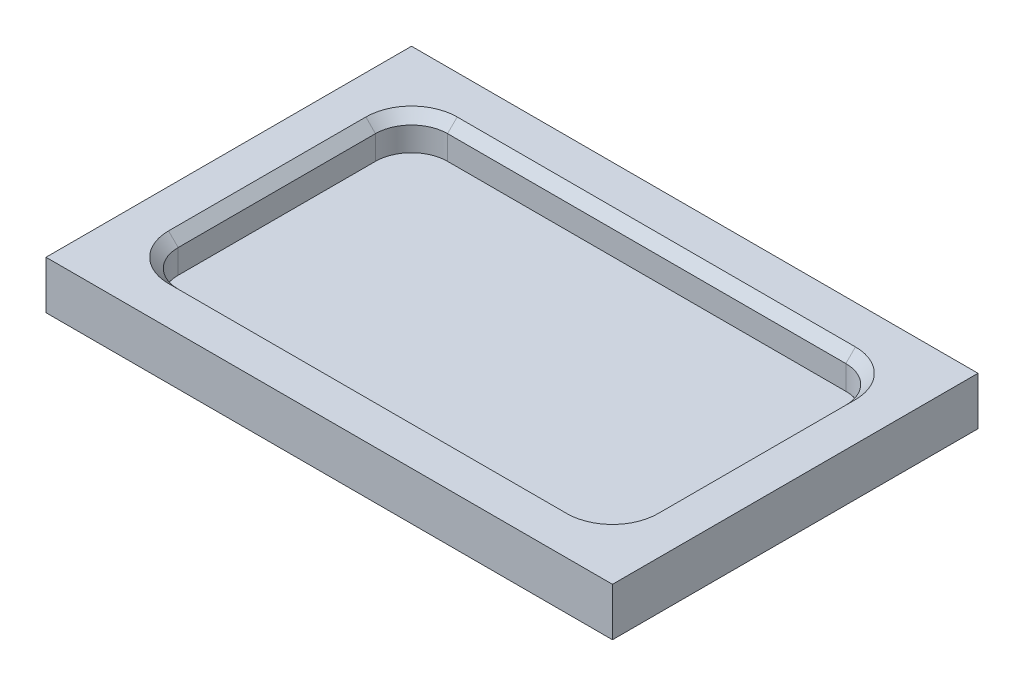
ISO-10303-21;
HEADER;
FILE_DESCRIPTION(('STEP AP214'),'2;1');
FILE_NAME('part.step','',(''),(''),'','','');
FILE_SCHEMA(('AUTOMOTIVE_DESIGN { 1 0 10303 214 1 1 1 1 }'));
ENDSEC;
DATA;
#1=APPLICATION_CONTEXT('core data for automotive mechanical design processes');
#2=APPLICATION_PROTOCOL_DEFINITION('international standard','automotive_design',2000,#1);
#3=PRODUCT_CONTEXT('',#1,'mechanical');
#4=PRODUCT('Part','Part','',(#3));
#5=PRODUCT_RELATED_PRODUCT_CATEGORY('part','',(#4));
#6=PRODUCT_DEFINITION_FORMATION('','',#4);
#7=PRODUCT_DEFINITION_CONTEXT('part definition',#1,'design');
#8=PRODUCT_DEFINITION('design','',#6,#7);
#9=PRODUCT_DEFINITION_SHAPE('','',#8);
#10=(LENGTH_UNIT() NAMED_UNIT(*) SI_UNIT(.MILLI.,.METRE.));
#11=(NAMED_UNIT(*) PLANE_ANGLE_UNIT() SI_UNIT($,.RADIAN.));
#12=(NAMED_UNIT(*) SI_UNIT($,.STERADIAN.) SOLID_ANGLE_UNIT());
#13=UNCERTAINTY_MEASURE_WITH_UNIT(LENGTH_MEASURE(1.E-05),#10,'distance_accuracy_value','');
#14=(GEOMETRIC_REPRESENTATION_CONTEXT(3) GLOBAL_UNCERTAINTY_ASSIGNED_CONTEXT((#13)) GLOBAL_UNIT_ASSIGNED_CONTEXT((#10,
#11,#12)) REPRESENTATION_CONTEXT('',''));
#15=CARTESIAN_POINT('',(0.,0.,0.));
#16=DIRECTION('',(0.,0.,1.));
#17=DIRECTION('',(1.,0.,0.));
#18=AXIS2_PLACEMENT_3D('',#15,#16,#17);
#19=CARTESIAN_POINT('',(-62.714146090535,12.7,-44.4034465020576));
#20=DIRECTION('',(1.,0.,0.));
#21=DIRECTION('',(0.,0.,-1.));
#22=AXIS2_PLACEMENT_3D('',#19,#20,#21);
#23=PLANE('',#22);
#24=DIRECTION('',(0.,0.,1.));
#25=VECTOR('',#24,1.);
#26=CARTESIAN_POINT('',(-62.714146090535,0.,-44.4034465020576));
#27=LINE('',#26,#25);
#28=CARTESIAN_POINT('',(-62.714146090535,0.,-44.4034465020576));
#29=VERTEX_POINT('',#28);
#30=CARTESIAN_POINT('',(-62.714146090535,0.,52.1854938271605));
#31=VERTEX_POINT('',#30);
#32=EDGE_CURVE('E155',#29,#31,#27,.T.);
#33=ORIENTED_EDGE('',*,*,#32,.T.);
#34=DIRECTION('',(0.,-1.,0.));
#35=VECTOR('',#34,1.);
#36=CARTESIAN_POINT('',(-62.714146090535,12.7,52.1854938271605));
#37=LINE('',#36,#35);
#38=CARTESIAN_POINT('',(-62.714146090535,12.7,52.1854938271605));
#39=VERTEX_POINT('',#38);
#40=EDGE_CURVE('E162',#39,#31,#37,.T.);
#41=ORIENTED_EDGE('',*,*,#40,.F.);
#42=DIRECTION('',(0.,0.,1.));
#43=VECTOR('',#42,1.);
#44=CARTESIAN_POINT('',(-62.714146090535,12.7,-44.4034465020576));
#45=LINE('',#44,#43);
#46=CARTESIAN_POINT('',(-62.714146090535,12.7,-44.4034465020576));
#47=VERTEX_POINT('',#46);
#48=EDGE_CURVE('E184',#47,#39,#45,.T.);
#49=ORIENTED_EDGE('',*,*,#48,.F.);
#50=DIRECTION('',(0.,-1.,0.));
#51=VECTOR('',#50,1.);
#52=CARTESIAN_POINT('',(-62.714146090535,12.7,-44.4034465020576));
#53=LINE('',#52,#51);
#54=EDGE_CURVE('E173',#47,#29,#53,.T.);
#55=ORIENTED_EDGE('',*,*,#54,.T.);
#56=EDGE_LOOP('',(#33,#41,#49,#55));
#57=FACE_BOUND('',#56,.T.);
#58=ADVANCED_FACE('F38',(#57),#23,.F.);
#59=CARTESIAN_POINT('',(-62.714146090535,12.7,52.1854938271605));
#60=DIRECTION('',(0.,0.,-1.));
#61=DIRECTION('',(-1.,0.,0.));
#62=AXIS2_PLACEMENT_3D('',#59,#60,#61);
#63=PLANE('',#62);
#64=DIRECTION('',(1.,0.,0.));
#65=VECTOR('',#64,1.);
#66=CARTESIAN_POINT('',(-62.714146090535,0.,52.1854938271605));
#67=LINE('',#66,#65);
#68=CARTESIAN_POINT('',(86.9758230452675,0.,52.1854938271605));
#69=VERTEX_POINT('',#68);
#70=EDGE_CURVE('E150',#31,#69,#67,.T.);
#71=ORIENTED_EDGE('',*,*,#70,.T.);
#72=DIRECTION('',(0.,-1.,0.));
#73=VECTOR('',#72,1.);
#74=CARTESIAN_POINT('',(86.9758230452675,12.7,52.1854938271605));
#75=LINE('',#74,#73);
#76=CARTESIAN_POINT('',(86.9758230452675,12.7,52.1854938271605));
#77=VERTEX_POINT('',#76);
#78=EDGE_CURVE('E169',#77,#69,#75,.T.);
#79=ORIENTED_EDGE('',*,*,#78,.F.);
#80=DIRECTION('',(1.,0.,0.));
#81=VECTOR('',#80,1.);
#82=CARTESIAN_POINT('',(-62.714146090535,12.7,52.1854938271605));
#83=LINE('',#82,#81);
#84=EDGE_CURVE('E164',#39,#77,#83,.T.);
#85=ORIENTED_EDGE('',*,*,#84,.F.);
#86=ORIENTED_EDGE('',*,*,#40,.T.);
#87=EDGE_LOOP('',(#71,#79,#85,#86));
#88=FACE_BOUND('',#87,.T.);
#89=ADVANCED_FACE('F163',(#88),#63,.F.);
#90=CARTESIAN_POINT('',(86.9758230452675,12.7,-44.4034465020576));
#91=DIRECTION('',(-1.,0.,0.));
#92=DIRECTION('',(0.,0.,1.));
#93=AXIS2_PLACEMENT_3D('',#90,#91,#92);
#94=PLANE('',#93);
#95=DIRECTION('',(0.,0.,-1.));
#96=VECTOR('',#95,1.);
#97=CARTESIAN_POINT('',(86.9758230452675,0.,-44.4034465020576));
#98=LINE('',#97,#96);
#99=CARTESIAN_POINT('',(86.9758230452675,0.,-44.4034465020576));
#100=VERTEX_POINT('',#99);
#101=EDGE_CURVE('E156',#69,#100,#98,.T.);
#102=ORIENTED_EDGE('',*,*,#101,.T.);
#103=DIRECTION('',(0.,-1.,0.));
#104=VECTOR('',#103,1.);
#105=CARTESIAN_POINT('',(86.9758230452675,12.7,-44.4034465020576));
#106=LINE('',#105,#104);
#107=CARTESIAN_POINT('',(86.9758230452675,12.7,-44.4034465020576));
#108=VERTEX_POINT('',#107);
#109=EDGE_CURVE('E192',#108,#100,#106,.T.);
#110=ORIENTED_EDGE('',*,*,#109,.F.);
#111=DIRECTION('',(0.,0.,-1.));
#112=VECTOR('',#111,1.);
#113=CARTESIAN_POINT('',(86.9758230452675,12.7,-44.4034465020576));
#114=LINE('',#113,#112);
#115=EDGE_CURVE('E187',#77,#108,#114,.T.);
#116=ORIENTED_EDGE('',*,*,#115,.F.);
#117=ORIENTED_EDGE('',*,*,#78,.T.);
#118=EDGE_LOOP('',(#102,#110,#116,#117));
#119=FACE_BOUND('',#118,.T.);
#120=ADVANCED_FACE('F352',(#119),#94,.F.);
#121=CARTESIAN_POINT('',(-62.714146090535,12.7,-44.4034465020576));
#122=DIRECTION('',(0.,0.,1.));
#123=DIRECTION('',(1.,0.,0.));
#124=AXIS2_PLACEMENT_3D('',#121,#122,#123);
#125=PLANE('',#124);
#126=DIRECTION('',(-1.,0.,0.));
#127=VECTOR('',#126,1.);
#128=CARTESIAN_POINT('',(-62.714146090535,0.,-44.4034465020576));
#129=LINE('',#128,#127);
#130=EDGE_CURVE('E182',#100,#29,#129,.T.);
#131=ORIENTED_EDGE('',*,*,#130,.T.);
#132=ORIENTED_EDGE('',*,*,#54,.F.);
#133=DIRECTION('',(-1.,0.,0.));
#134=VECTOR('',#133,1.);
#135=CARTESIAN_POINT('',(-62.714146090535,12.7,-44.4034465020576));
#136=LINE('',#135,#134);
#137=EDGE_CURVE('E189',#108,#47,#136,.T.);
#138=ORIENTED_EDGE('',*,*,#137,.F.);
#139=ORIENTED_EDGE('',*,*,#109,.T.);
#140=EDGE_LOOP('',(#131,#132,#138,#139));
#141=FACE_BOUND('',#140,.T.);
#142=ADVANCED_FACE('F345',(#141),#125,.F.);
#143=CARTESIAN_POINT('',(-62.714146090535,12.7,52.1854938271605));
#144=DIRECTION('',(0.,1.,0.));
#145=DIRECTION('',(0.,0.,1.));
#146=AXIS2_PLACEMENT_3D('',#143,#144,#145);
#147=PLANE('',#146);
#148=CARTESIAN_POINT('',(64.7508230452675,12.7,29.9604938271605));
#149=DIRECTION('',(0.,1.,0.));
#150=DIRECTION('',(0.,0.,1.));
#151=AXIS2_PLACEMENT_3D('',#148,#149,#150);
#152=CIRCLE('',#151,12.065);
#153=CARTESIAN_POINT('',(76.8158230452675,12.7,29.9604938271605));
#154=VERTEX_POINT('',#153);
#155=CARTESIAN_POINT('',(64.7508230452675,12.7,42.0254938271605));
#156=VERTEX_POINT('',#155);
#157=EDGE_CURVE('E237',#154,#156,#152,.F.);
#158=ORIENTED_EDGE('',*,*,#157,.T.);
#159=DIRECTION('',(-1.,0.,0.));
#160=VECTOR('',#159,1.);
#161=CARTESIAN_POINT('',(-40.489146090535,12.7,42.0254938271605));
#162=LINE('',#161,#160);
#163=CARTESIAN_POINT('',(-40.489146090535,12.7,42.0254938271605));
#164=VERTEX_POINT('',#163);
#165=EDGE_CURVE('E239',#156,#164,#162,.T.);
#166=ORIENTED_EDGE('',*,*,#165,.T.);
#167=CARTESIAN_POINT('',(-40.489146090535,12.7,29.9604938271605));
#168=DIRECTION('',(0.,1.,0.));
#169=DIRECTION('',(0.,0.,1.));
#170=AXIS2_PLACEMENT_3D('',#167,#168,#169);
#171=CIRCLE('',#170,12.065);
#172=CARTESIAN_POINT('',(-52.554146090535,12.7,29.9604938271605));
#173=VERTEX_POINT('',#172);
#174=EDGE_CURVE('E235',#164,#173,#171,.F.);
#175=ORIENTED_EDGE('',*,*,#174,.T.);
#176=DIRECTION('',(0.,0.,-1.));
#177=VECTOR('',#176,1.);
#178=CARTESIAN_POINT('',(-52.554146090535,12.7,-22.1784465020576));
#179=LINE('',#178,#177);
#180=CARTESIAN_POINT('',(-52.554146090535,12.7,-22.1784465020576));
#181=VERTEX_POINT('',#180);
#182=EDGE_CURVE('E231',#173,#181,#179,.T.);
#183=ORIENTED_EDGE('',*,*,#182,.T.);
#184=CARTESIAN_POINT('',(-40.489146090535,12.7,-22.1784465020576));
#185=DIRECTION('',(0.,1.,0.));
#186=DIRECTION('',(0.,0.,1.));
#187=AXIS2_PLACEMENT_3D('',#184,#185,#186);
#188=CIRCLE('',#187,12.065);
#189=CARTESIAN_POINT('',(-40.489146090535,12.7,-34.2434465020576));
#190=VERTEX_POINT('',#189);
#191=EDGE_CURVE('E227',#181,#190,#188,.F.);
#192=ORIENTED_EDGE('',*,*,#191,.T.);
#193=DIRECTION('',(1.,0.,0.));
#194=VECTOR('',#193,1.);
#195=CARTESIAN_POINT('',(64.7508230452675,12.7,-34.2434465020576));
#196=LINE('',#195,#194);
#197=CARTESIAN_POINT('',(64.7508230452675,12.7,-34.2434465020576));
#198=VERTEX_POINT('',#197);
#199=EDGE_CURVE('E225',#190,#198,#196,.T.);
#200=ORIENTED_EDGE('',*,*,#199,.T.);
#201=CARTESIAN_POINT('',(64.7508230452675,12.7,-22.1784465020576));
#202=DIRECTION('',(0.,1.,0.));
#203=DIRECTION('',(0.,0.,1.));
#204=AXIS2_PLACEMENT_3D('',#201,#202,#203);
#205=CIRCLE('',#204,12.065);
#206=CARTESIAN_POINT('',(76.8158230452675,12.7,-22.1784465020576));
#207=VERTEX_POINT('',#206);
#208=EDGE_CURVE('E229',#198,#207,#205,.F.);
#209=ORIENTED_EDGE('',*,*,#208,.T.);
#210=DIRECTION('',(0.,0.,1.));
#211=VECTOR('',#210,1.);
#212=CARTESIAN_POINT('',(76.8158230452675,12.7,29.9604938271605));
#213=LINE('',#212,#211);
#214=EDGE_CURVE('E233',#207,#154,#213,.T.);
#215=ORIENTED_EDGE('',*,*,#214,.T.);
#216=EDGE_LOOP('',(#158,#166,#175,#183,#192,#200,#209,#215));
#217=FACE_BOUND('',#216,.T.);
#218=ORIENTED_EDGE('',*,*,#48,.T.);
#219=ORIENTED_EDGE('',*,*,#84,.T.);
#220=ORIENTED_EDGE('',*,*,#115,.T.);
#221=ORIENTED_EDGE('',*,*,#137,.T.);
#222=EDGE_LOOP('',(#218,#219,#220,#221));
#223=FACE_BOUND('',#222,.T.);
#224=ADVANCED_FACE('F342',(#217,#223),#147,.T.);
#225=CARTESIAN_POINT('',(-62.714146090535,0.,52.1854938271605));
#226=DIRECTION('',(0.,1.,0.));
#227=DIRECTION('',(0.,0.,1.));
#228=AXIS2_PLACEMENT_3D('',#225,#226,#227);
#229=PLANE('',#228);
#230=ORIENTED_EDGE('',*,*,#32,.F.);
#231=ORIENTED_EDGE('',*,*,#130,.F.);
#232=ORIENTED_EDGE('',*,*,#101,.F.);
#233=ORIENTED_EDGE('',*,*,#70,.F.);
#234=EDGE_LOOP('',(#230,#231,#232,#233));
#235=FACE_BOUND('',#234,.T.);
#236=ADVANCED_FACE('F152',(#235),#229,.F.);
#237=CARTESIAN_POINT('',(-50.014146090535,3.81,-31.7034465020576));
#238=DIRECTION('',(-1.,0.,0.));
#239=DIRECTION('',(0.,0.,1.));
#240=AXIS2_PLACEMENT_3D('',#237,#238,#239);
#241=PLANE('',#240);
#242=DIRECTION('',(0.,1.,0.));
#243=VECTOR('',#242,1.);
#244=CARTESIAN_POINT('',(-50.014146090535,12.7,-22.1784465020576));
#245=LINE('',#244,#243);
#246=CARTESIAN_POINT('',(-50.014146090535,3.81,-22.1784465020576));
#247=VERTEX_POINT('',#246);
#248=CARTESIAN_POINT('',(-50.014146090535,10.16,-22.1784465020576));
#249=VERTEX_POINT('',#248);
#250=EDGE_CURVE('E217',#247,#249,#245,.T.);
#251=ORIENTED_EDGE('',*,*,#250,.T.);
#252=DIRECTION('',(0.,0.,1.));
#253=VECTOR('',#252,1.);
#254=CARTESIAN_POINT('',(-50.014146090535,10.16,29.9604938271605));
#255=LINE('',#254,#253);
#256=CARTESIAN_POINT('',(-50.014146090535,10.16,29.9604938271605));
#257=VERTEX_POINT('',#256);
#258=EDGE_CURVE('E248',#249,#257,#255,.T.);
#259=ORIENTED_EDGE('',*,*,#258,.T.);
#260=DIRECTION('',(0.,1.,0.));
#261=VECTOR('',#260,1.);
#262=CARTESIAN_POINT('',(-50.014146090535,3.81,29.9604938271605));
#263=LINE('',#262,#261);
#264=CARTESIAN_POINT('',(-50.014146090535,3.81,29.9604938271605));
#265=VERTEX_POINT('',#264);
#266=EDGE_CURVE('E220',#257,#265,#263,.F.);
#267=ORIENTED_EDGE('',*,*,#266,.T.);
#268=DIRECTION('',(0.,0.,1.));
#269=VECTOR('',#268,1.);
#270=CARTESIAN_POINT('',(-50.014146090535,3.81,-31.7034465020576));
#271=LINE('',#270,#269);
#272=EDGE_CURVE('E265',#247,#265,#271,.T.);
#273=ORIENTED_EDGE('',*,*,#272,.F.);
#274=EDGE_LOOP('',(#251,#259,#267,#273));
#275=FACE_BOUND('',#274,.T.);
#276=ADVANCED_FACE('F261',(#275),#241,.F.);
#277=CARTESIAN_POINT('',(-50.014146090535,3.81,-31.7034465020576));
#278=DIRECTION('',(0.,0.,-1.));
#279=DIRECTION('',(-1.,0.,0.));
#280=AXIS2_PLACEMENT_3D('',#277,#278,#279);
#281=PLANE('',#280);
#282=DIRECTION('',(0.,1.,0.));
#283=VECTOR('',#282,1.);
#284=CARTESIAN_POINT('',(64.7508230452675,12.7,-31.7034465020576));
#285=LINE('',#284,#283);
#286=CARTESIAN_POINT('',(64.7508230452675,3.81,-31.7034465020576));
#287=VERTEX_POINT('',#286);
#288=CARTESIAN_POINT('',(64.7508230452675,10.16,-31.7034465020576));
#289=VERTEX_POINT('',#288);
#290=EDGE_CURVE('E197',#287,#289,#285,.T.);
#291=ORIENTED_EDGE('',*,*,#290,.T.);
#292=DIRECTION('',(-1.,0.,0.));
#293=VECTOR('',#292,1.);
#294=CARTESIAN_POINT('',(-40.489146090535,10.16,-31.7034465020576));
#295=LINE('',#294,#293);
#296=CARTESIAN_POINT('',(-40.489146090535,10.16,-31.7034465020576));
#297=VERTEX_POINT('',#296);
#298=EDGE_CURVE('E11',#289,#297,#295,.T.);
#299=ORIENTED_EDGE('',*,*,#298,.T.);
#300=DIRECTION('',(0.,1.,0.));
#301=VECTOR('',#300,1.);
#302=CARTESIAN_POINT('',(-40.489146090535,3.81,-31.7034465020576));
#303=LINE('',#302,#301);
#304=CARTESIAN_POINT('',(-40.489146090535,3.81,-31.7034465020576));
#305=VERTEX_POINT('',#304);
#306=EDGE_CURVE('E168',#297,#305,#303,.F.);
#307=ORIENTED_EDGE('',*,*,#306,.T.);
#308=DIRECTION('',(-1.,0.,0.));
#309=VECTOR('',#308,1.);
#310=CARTESIAN_POINT('',(-50.014146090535,3.81,-31.7034465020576));
#311=LINE('',#310,#309);
#312=EDGE_CURVE('E174',#287,#305,#311,.T.);
#313=ORIENTED_EDGE('',*,*,#312,.F.);
#314=EDGE_LOOP('',(#291,#299,#307,#313));
#315=FACE_BOUND('',#314,.T.);
#316=ADVANCED_FACE('F415',(#315),#281,.F.);
#317=CARTESIAN_POINT('',(74.2758230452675,3.81,-31.7034465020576));
#318=DIRECTION('',(1.,0.,0.));
#319=DIRECTION('',(0.,0.,-1.));
#320=AXIS2_PLACEMENT_3D('',#317,#318,#319);
#321=PLANE('',#320);
#322=DIRECTION('',(0.,1.,0.));
#323=VECTOR('',#322,1.);
#324=CARTESIAN_POINT('',(74.2758230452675,12.7,29.9604938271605));
#325=LINE('',#324,#323);
#326=CARTESIAN_POINT('',(74.2758230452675,3.81,29.9604938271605));
#327=VERTEX_POINT('',#326);
#328=CARTESIAN_POINT('',(74.2758230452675,10.16,29.9604938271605));
#329=VERTEX_POINT('',#328);
#330=EDGE_CURVE('E199',#327,#329,#325,.T.);
#331=ORIENTED_EDGE('',*,*,#330,.T.);
#332=DIRECTION('',(0.,0.,-1.));
#333=VECTOR('',#332,1.);
#334=CARTESIAN_POINT('',(74.2758230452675,10.16,-22.1784465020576));
#335=LINE('',#334,#333);
#336=CARTESIAN_POINT('',(74.2758230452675,10.16,-22.1784465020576));
#337=VERTEX_POINT('',#336);
#338=EDGE_CURVE('E246',#329,#337,#335,.T.);
#339=ORIENTED_EDGE('',*,*,#338,.T.);
#340=DIRECTION('',(0.,1.,0.));
#341=VECTOR('',#340,1.);
#342=CARTESIAN_POINT('',(74.2758230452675,3.81,-22.1784465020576));
#343=LINE('',#342,#341);
#344=CARTESIAN_POINT('',(74.2758230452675,3.81,-22.1784465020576));
#345=VERTEX_POINT('',#344);
#346=EDGE_CURVE('E202',#337,#345,#343,.F.);
#347=ORIENTED_EDGE('',*,*,#346,.T.);
#348=DIRECTION('',(0.,0.,-1.));
#349=VECTOR('',#348,1.);
#350=CARTESIAN_POINT('',(74.2758230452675,3.81,-31.7034465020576));
#351=LINE('',#350,#349);
#352=EDGE_CURVE('E177',#327,#345,#351,.T.);
#353=ORIENTED_EDGE('',*,*,#352,.F.);
#354=EDGE_LOOP('',(#331,#339,#347,#353));
#355=FACE_BOUND('',#354,.T.);
#356=ADVANCED_FACE('F329',(#355),#321,.F.);
#357=CARTESIAN_POINT('',(-50.014146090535,3.81,39.4854938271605));
#358=DIRECTION('',(0.,0.,1.));
#359=DIRECTION('',(1.,0.,0.));
#360=AXIS2_PLACEMENT_3D('',#357,#358,#359);
#361=PLANE('',#360);
#362=DIRECTION('',(0.,1.,0.));
#363=VECTOR('',#362,1.);
#364=CARTESIAN_POINT('',(-40.489146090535,12.7,39.4854938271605));
#365=LINE('',#364,#363);
#366=CARTESIAN_POINT('',(-40.489146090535,3.81,39.4854938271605));
#367=VERTEX_POINT('',#366);
#368=CARTESIAN_POINT('',(-40.489146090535,10.16,39.4854938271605));
#369=VERTEX_POINT('',#368);
#370=EDGE_CURVE('E212',#367,#369,#365,.T.);
#371=ORIENTED_EDGE('',*,*,#370,.T.);
#372=DIRECTION('',(1.,0.,0.));
#373=VECTOR('',#372,1.);
#374=CARTESIAN_POINT('',(64.7508230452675,10.16,39.4854938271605));
#375=LINE('',#374,#373);
#376=CARTESIAN_POINT('',(64.7508230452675,10.16,39.4854938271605));
#377=VERTEX_POINT('',#376);
#378=EDGE_CURVE('E222',#369,#377,#375,.T.);
#379=ORIENTED_EDGE('',*,*,#378,.T.);
#380=DIRECTION('',(0.,1.,0.));
#381=VECTOR('',#380,1.);
#382=CARTESIAN_POINT('',(64.7508230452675,3.81,39.4854938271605));
#383=LINE('',#382,#381);
#384=CARTESIAN_POINT('',(64.7508230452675,3.81,39.4854938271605));
#385=VERTEX_POINT('',#384);
#386=EDGE_CURVE('E215',#377,#385,#383,.F.);
#387=ORIENTED_EDGE('',*,*,#386,.T.);
#388=DIRECTION('',(1.,0.,0.));
#389=VECTOR('',#388,1.);
#390=CARTESIAN_POINT('',(-50.014146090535,3.81,39.4854938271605));
#391=LINE('',#390,#389);
#392=EDGE_CURVE('E297',#367,#385,#391,.T.);
#393=ORIENTED_EDGE('',*,*,#392,.F.);
#394=EDGE_LOOP('',(#371,#379,#387,#393));
#395=FACE_BOUND('',#394,.T.);
#396=ADVANCED_FACE('F294',(#395),#361,.F.);
#397=CARTESIAN_POINT('',(-50.014146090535,3.81,39.4854938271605));
#398=DIRECTION('',(0.,1.,0.));
#399=DIRECTION('',(0.,0.,1.));
#400=AXIS2_PLACEMENT_3D('',#397,#398,#399);
#401=PLANE('',#400);
#402=ORIENTED_EDGE('',*,*,#352,.T.);
#403=CARTESIAN_POINT('',(64.7508230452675,3.81,-22.1784465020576));
#404=DIRECTION('',(0.,1.,0.));
#405=DIRECTION('',(0.,0.,1.));
#406=AXIS2_PLACEMENT_3D('',#403,#404,#405);
#407=CIRCLE('',#406,9.525);
#408=EDGE_CURVE('E210',#345,#287,#407,.T.);
#409=ORIENTED_EDGE('',*,*,#408,.T.);
#410=ORIENTED_EDGE('',*,*,#312,.T.);
#411=CARTESIAN_POINT('',(-40.489146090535,3.81,-22.1784465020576));
#412=DIRECTION('',(0.,1.,0.));
#413=DIRECTION('',(0.,0.,1.));
#414=AXIS2_PLACEMENT_3D('',#411,#412,#413);
#415=CIRCLE('',#414,9.525);
#416=EDGE_CURVE('E204',#305,#247,#415,.T.);
#417=ORIENTED_EDGE('',*,*,#416,.T.);
#418=ORIENTED_EDGE('',*,*,#272,.T.);
#419=CARTESIAN_POINT('',(-40.489146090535,3.81,29.9604938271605));
#420=DIRECTION('',(0.,1.,0.));
#421=DIRECTION('',(0.,0.,1.));
#422=AXIS2_PLACEMENT_3D('',#419,#420,#421);
#423=CIRCLE('',#422,9.525);
#424=EDGE_CURVE('E206',#265,#367,#423,.T.);
#425=ORIENTED_EDGE('',*,*,#424,.T.);
#426=ORIENTED_EDGE('',*,*,#392,.T.);
#427=CARTESIAN_POINT('',(64.7508230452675,3.81,29.9604938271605));
#428=DIRECTION('',(0.,1.,0.));
#429=DIRECTION('',(0.,0.,1.));
#430=AXIS2_PLACEMENT_3D('',#427,#428,#429);
#431=CIRCLE('',#430,9.525);
#432=EDGE_CURVE('E208',#385,#327,#431,.T.);
#433=ORIENTED_EDGE('',*,*,#432,.T.);
#434=EDGE_LOOP('',(#402,#409,#410,#417,#418,#425,#426,#433));
#435=FACE_BOUND('',#434,.T.);
#436=ADVANCED_FACE('F393',(#435),#401,.T.);
#437=CARTESIAN_POINT('',(64.7508230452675,3.81,-22.1784465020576));
#438=DIRECTION('',(0.,-1.,0.));
#439=DIRECTION('',(0.,0.,-1.));
#440=AXIS2_PLACEMENT_3D('',#437,#438,#439);
#441=CYLINDRICAL_SURFACE('',#440,9.525);
#442=ORIENTED_EDGE('',*,*,#346,.F.);
#443=CARTESIAN_POINT('',(64.7508230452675,10.16,-22.1784465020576));
#444=DIRECTION('',(0.,1.,0.));
#445=DIRECTION('',(0.,0.,1.));
#446=AXIS2_PLACEMENT_3D('',#443,#444,#445);
#447=CIRCLE('',#446,9.525);
#448=EDGE_CURVE('E58',#337,#289,#447,.T.);
#449=ORIENTED_EDGE('',*,*,#448,.T.);
#450=ORIENTED_EDGE('',*,*,#290,.F.);
#451=ORIENTED_EDGE('',*,*,#408,.F.);
#452=EDGE_LOOP('',(#442,#449,#450,#451));
#453=FACE_BOUND('',#452,.T.);
#454=ADVANCED_FACE('F398',(#453),#441,.F.);
#455=CARTESIAN_POINT('',(64.7508230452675,3.81,29.9604938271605));
#456=DIRECTION('',(0.,-1.,0.));
#457=DIRECTION('',(0.,0.,-1.));
#458=AXIS2_PLACEMENT_3D('',#455,#456,#457);
#459=CYLINDRICAL_SURFACE('',#458,9.525);
#460=ORIENTED_EDGE('',*,*,#386,.F.);
#461=CARTESIAN_POINT('',(64.7508230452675,10.16,29.9604938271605));
#462=DIRECTION('',(0.,1.,0.));
#463=DIRECTION('',(0.,0.,1.));
#464=AXIS2_PLACEMENT_3D('',#461,#462,#463);
#465=CIRCLE('',#464,9.525);
#466=EDGE_CURVE('E242',#377,#329,#465,.T.);
#467=ORIENTED_EDGE('',*,*,#466,.T.);
#468=ORIENTED_EDGE('',*,*,#330,.F.);
#469=ORIENTED_EDGE('',*,*,#432,.F.);
#470=EDGE_LOOP('',(#460,#467,#468,#469));
#471=FACE_BOUND('',#470,.T.);
#472=ADVANCED_FACE('F325',(#471),#459,.F.);
#473=CARTESIAN_POINT('',(-40.489146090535,3.81,29.9604938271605));
#474=DIRECTION('',(0.,-1.,0.));
#475=DIRECTION('',(0.,0.,-1.));
#476=AXIS2_PLACEMENT_3D('',#473,#474,#475);
#477=CYLINDRICAL_SURFACE('',#476,9.525);
#478=ORIENTED_EDGE('',*,*,#266,.F.);
#479=CARTESIAN_POINT('',(-40.489146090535,10.16,29.9604938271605));
#480=DIRECTION('',(0.,1.,0.));
#481=DIRECTION('',(0.,0.,1.));
#482=AXIS2_PLACEMENT_3D('',#479,#480,#481);
#483=CIRCLE('',#482,9.525);
#484=EDGE_CURVE('E244',#257,#369,#483,.T.);
#485=ORIENTED_EDGE('',*,*,#484,.T.);
#486=ORIENTED_EDGE('',*,*,#370,.F.);
#487=ORIENTED_EDGE('',*,*,#424,.F.);
#488=EDGE_LOOP('',(#478,#485,#486,#487));
#489=FACE_BOUND('',#488,.T.);
#490=ADVANCED_FACE('F290',(#489),#477,.F.);
#491=CARTESIAN_POINT('',(-40.489146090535,3.81,-22.1784465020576));
#492=DIRECTION('',(0.,-1.,0.));
#493=DIRECTION('',(0.,0.,-1.));
#494=AXIS2_PLACEMENT_3D('',#491,#492,#493);
#495=CYLINDRICAL_SURFACE('',#494,9.525);
#496=ORIENTED_EDGE('',*,*,#306,.F.);
#497=CARTESIAN_POINT('',(-40.489146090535,10.16,-22.1784465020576));
#498=DIRECTION('',(0.,1.,0.));
#499=DIRECTION('',(0.,0.,1.));
#500=AXIS2_PLACEMENT_3D('',#497,#498,#499);
#501=CIRCLE('',#500,9.525);
#502=EDGE_CURVE('E45',#297,#249,#501,.T.);
#503=ORIENTED_EDGE('',*,*,#502,.T.);
#504=ORIENTED_EDGE('',*,*,#250,.F.);
#505=ORIENTED_EDGE('',*,*,#416,.F.);
#506=EDGE_LOOP('',(#496,#503,#504,#505));
#507=FACE_BOUND('',#506,.T.);
#508=ADVANCED_FACE('F253',(#507),#495,.F.);
#509=CARTESIAN_POINT('',(-50.014146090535,10.16,-31.7034465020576));
#510=DIRECTION('',(0.,0.707106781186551,0.707106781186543));
#511=DIRECTION('',(0.,-0.707106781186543,0.707106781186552));
#512=AXIS2_PLACEMENT_3D('',#509,#510,#511);
#513=PLANE('',#512);
#514=DIRECTION('',(0.,-0.707106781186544,0.707106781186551));
#515=VECTOR('',#514,1.);
#516=CARTESIAN_POINT('',(64.7508230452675,12.7,-34.2434465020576));
#517=LINE('',#516,#515);
#518=EDGE_CURVE('E272',#198,#289,#517,.T.);
#519=ORIENTED_EDGE('',*,*,#518,.F.);
#520=ORIENTED_EDGE('',*,*,#199,.F.);
#521=DIRECTION('',(0.,0.707106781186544,-0.707106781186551));
#522=VECTOR('',#521,1.);
#523=CARTESIAN_POINT('',(-40.489146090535,10.16,-31.7034465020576));
#524=LINE('',#523,#522);
#525=EDGE_CURVE('E302',#297,#190,#524,.T.);
#526=ORIENTED_EDGE('',*,*,#525,.F.);
#527=ORIENTED_EDGE('',*,*,#298,.F.);
#528=EDGE_LOOP('',(#519,#520,#526,#527));
#529=FACE_BOUND('',#528,.T.);
#530=ADVANCED_FACE('F340',(#529),#513,.T.);
#531=CARTESIAN_POINT('',(-40.489146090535,12.7,-22.1784465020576));
#532=DIRECTION('',(0.,1.,0.));
#533=DIRECTION('',(0.,0.,1.));
#534=AXIS2_PLACEMENT_3D('',#531,#532,#533);
#535=CONICAL_SURFACE('',#534,12.065,0.785398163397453);
#536=ORIENTED_EDGE('',*,*,#525,.T.);
#537=ORIENTED_EDGE('',*,*,#191,.F.);
#538=DIRECTION('',(-0.707106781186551,0.707106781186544,0.));
#539=VECTOR('',#538,1.);
#540=CARTESIAN_POINT('',(-50.014146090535,10.16,-22.1784465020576));
#541=LINE('',#540,#539);
#542=EDGE_CURVE('E268',#249,#181,#541,.T.);
#543=ORIENTED_EDGE('',*,*,#542,.F.);
#544=ORIENTED_EDGE('',*,*,#502,.F.);
#545=EDGE_LOOP('',(#536,#537,#543,#544));
#546=FACE_BOUND('',#545,.T.);
#547=ADVANCED_FACE('F269',(#546),#535,.F.);
#548=CARTESIAN_POINT('',(64.7508230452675,12.7,-22.1784465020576));
#549=DIRECTION('',(0.,1.,0.));
#550=DIRECTION('',(0.,0.,1.));
#551=AXIS2_PLACEMENT_3D('',#548,#549,#550);
#552=CONICAL_SURFACE('',#551,12.065,0.785398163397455);
#553=ORIENTED_EDGE('',*,*,#518,.T.);
#554=ORIENTED_EDGE('',*,*,#448,.F.);
#555=DIRECTION('',(-0.707106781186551,-0.707106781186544,0.));
#556=VECTOR('',#555,1.);
#557=CARTESIAN_POINT('',(76.8158230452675,12.7,-22.1784465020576));
#558=LINE('',#557,#556);
#559=EDGE_CURVE('E273',#207,#337,#558,.T.);
#560=ORIENTED_EDGE('',*,*,#559,.F.);
#561=ORIENTED_EDGE('',*,*,#208,.F.);
#562=EDGE_LOOP('',(#553,#554,#560,#561));
#563=FACE_BOUND('',#562,.T.);
#564=ADVANCED_FACE('F336',(#563),#552,.F.);
#565=CARTESIAN_POINT('',(-50.014146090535,10.16,-31.7034465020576));
#566=DIRECTION('',(0.707106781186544,0.707106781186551,0.));
#567=DIRECTION('',(-0.707106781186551,0.707106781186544,0.));
#568=AXIS2_PLACEMENT_3D('',#565,#566,#567);
#569=PLANE('',#568);
#570=ORIENTED_EDGE('',*,*,#542,.T.);
#571=ORIENTED_EDGE('',*,*,#182,.F.);
#572=DIRECTION('',(-0.707106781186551,0.707106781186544,0.));
#573=VECTOR('',#572,1.);
#574=CARTESIAN_POINT('',(-50.014146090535,10.16,29.9604938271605));
#575=LINE('',#574,#573);
#576=EDGE_CURVE('E278',#257,#173,#575,.T.);
#577=ORIENTED_EDGE('',*,*,#576,.F.);
#578=ORIENTED_EDGE('',*,*,#258,.F.);
#579=EDGE_LOOP('',(#570,#571,#577,#578));
#580=FACE_BOUND('',#579,.T.);
#581=ADVANCED_FACE('F276',(#580),#569,.T.);
#582=CARTESIAN_POINT('',(74.2758230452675,10.16,-31.7034465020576));
#583=DIRECTION('',(-0.707106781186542,0.707106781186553,0.));
#584=DIRECTION('',(-0.707106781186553,-0.707106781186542,0.));
#585=AXIS2_PLACEMENT_3D('',#582,#583,#584);
#586=PLANE('',#585);
#587=ORIENTED_EDGE('',*,*,#559,.T.);
#588=ORIENTED_EDGE('',*,*,#338,.F.);
#589=DIRECTION('',(-0.707106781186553,-0.707106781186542,0.));
#590=VECTOR('',#589,1.);
#591=CARTESIAN_POINT('',(76.8158230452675,12.7,29.9604938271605));
#592=LINE('',#591,#590);
#593=EDGE_CURVE('E282',#154,#329,#592,.T.);
#594=ORIENTED_EDGE('',*,*,#593,.F.);
#595=ORIENTED_EDGE('',*,*,#214,.F.);
#596=EDGE_LOOP('',(#587,#588,#594,#595));
#597=FACE_BOUND('',#596,.T.);
#598=ADVANCED_FACE('F331',(#597),#586,.T.);
#599=CARTESIAN_POINT('',(-40.489146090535,12.7,29.9604938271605));
#600=DIRECTION('',(0.,1.,0.));
#601=DIRECTION('',(0.,0.,1.));
#602=AXIS2_PLACEMENT_3D('',#599,#600,#601);
#603=CONICAL_SURFACE('',#602,12.065,0.785398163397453);
#604=ORIENTED_EDGE('',*,*,#576,.T.);
#605=ORIENTED_EDGE('',*,*,#174,.F.);
#606=DIRECTION('',(0.,0.707106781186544,0.707106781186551));
#607=VECTOR('',#606,1.);
#608=CARTESIAN_POINT('',(-40.489146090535,10.16,39.4854938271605));
#609=LINE('',#608,#607);
#610=EDGE_CURVE('E286',#369,#164,#609,.T.);
#611=ORIENTED_EDGE('',*,*,#610,.F.);
#612=ORIENTED_EDGE('',*,*,#484,.F.);
#613=EDGE_LOOP('',(#604,#605,#611,#612));
#614=FACE_BOUND('',#613,.T.);
#615=ADVANCED_FACE('F285',(#614),#603,.F.);
#616=CARTESIAN_POINT('',(64.7508230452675,12.7,29.9604938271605));
#617=DIRECTION('',(0.,1.,0.));
#618=DIRECTION('',(0.,0.,1.));
#619=AXIS2_PLACEMENT_3D('',#616,#617,#618);
#620=CONICAL_SURFACE('',#619,12.065,0.785398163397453);
#621=ORIENTED_EDGE('',*,*,#593,.T.);
#622=ORIENTED_EDGE('',*,*,#466,.F.);
#623=DIRECTION('',(0.,-0.707106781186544,-0.707106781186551));
#624=VECTOR('',#623,1.);
#625=CARTESIAN_POINT('',(64.7508230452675,12.7,42.0254938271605));
#626=LINE('',#625,#624);
#627=EDGE_CURVE('E313',#156,#377,#626,.T.);
#628=ORIENTED_EDGE('',*,*,#627,.F.);
#629=ORIENTED_EDGE('',*,*,#157,.F.);
#630=EDGE_LOOP('',(#621,#622,#628,#629));
#631=FACE_BOUND('',#630,.T.);
#632=ADVANCED_FACE('F321',(#631),#620,.F.);
#633=CARTESIAN_POINT('',(-50.014146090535,10.16,39.4854938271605));
#634=DIRECTION('',(0.,0.707106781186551,-0.707106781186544));
#635=DIRECTION('',(0.,0.707106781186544,0.707106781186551));
#636=AXIS2_PLACEMENT_3D('',#633,#634,#635);
#637=PLANE('',#636);
#638=ORIENTED_EDGE('',*,*,#610,.T.);
#639=ORIENTED_EDGE('',*,*,#165,.F.);
#640=ORIENTED_EDGE('',*,*,#627,.T.);
#641=ORIENTED_EDGE('',*,*,#378,.F.);
#642=EDGE_LOOP('',(#638,#639,#640,#641));
#643=FACE_BOUND('',#642,.T.);
#644=ADVANCED_FACE('F318',(#643),#637,.T.);
#645=CLOSED_SHELL('',(#58,#89,#120,#142,#224,#236,#276,#316,#356,#396,#436,#454,#472,#490,#508,
#530,#547,#564,#581,#598,#615,#632,#644));
#646=MANIFOLD_SOLID_BREP('B2',#645);
#647=ADVANCED_BREP_SHAPE_REPRESENTATION('',(#18,#646),#14);
#648=SHAPE_DEFINITION_REPRESENTATION(#9,#647);
ENDSEC;
END-ISO-10303-21;
